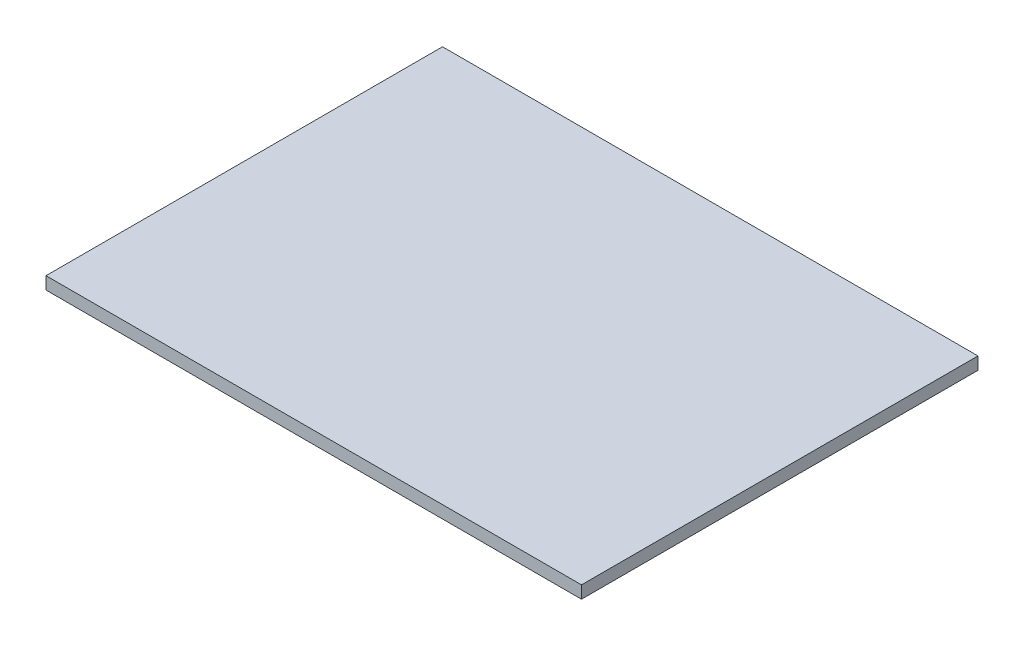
ISO-10303-21;
HEADER;
FILE_DESCRIPTION(('STEP AP214'),'2;1');
FILE_NAME('part.step','',(''),(''),'','','');
FILE_SCHEMA(('AUTOMOTIVE_DESIGN { 1 0 10303 214 1 1 1 1 }'));
ENDSEC;
DATA;
#1=APPLICATION_CONTEXT('core data for automotive mechanical design processes');
#2=APPLICATION_PROTOCOL_DEFINITION('international standard','automotive_design',2000,#1);
#3=PRODUCT_CONTEXT('',#1,'mechanical');
#4=PRODUCT('Part','Part','',(#3));
#5=PRODUCT_RELATED_PRODUCT_CATEGORY('part','',(#4));
#6=PRODUCT_DEFINITION_FORMATION('','',#4);
#7=PRODUCT_DEFINITION_CONTEXT('part definition',#1,'design');
#8=PRODUCT_DEFINITION('design','',#6,#7);
#9=PRODUCT_DEFINITION_SHAPE('','',#8);
#10=(LENGTH_UNIT() NAMED_UNIT(*) SI_UNIT(.MILLI.,.METRE.));
#11=(NAMED_UNIT(*) PLANE_ANGLE_UNIT() SI_UNIT($,.RADIAN.));
#12=(NAMED_UNIT(*) SI_UNIT($,.STERADIAN.) SOLID_ANGLE_UNIT());
#13=UNCERTAINTY_MEASURE_WITH_UNIT(LENGTH_MEASURE(1.E-05),#10,'distance_accuracy_value','');
#14=(GEOMETRIC_REPRESENTATION_CONTEXT(3) GLOBAL_UNCERTAINTY_ASSIGNED_CONTEXT((#13)) GLOBAL_UNIT_ASSIGNED_CONTEXT((#10,
#11,#12)) REPRESENTATION_CONTEXT('',''));
#15=CARTESIAN_POINT('',(0.,0.,0.));
#16=DIRECTION('',(0.,0.,1.));
#17=DIRECTION('',(1.,0.,0.));
#18=AXIS2_PLACEMENT_3D('',#15,#16,#17);
#19=CARTESIAN_POINT('',(-8.12013274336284,2.54,11.6596777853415));
#20=DIRECTION('',(1.,0.,0.));
#21=DIRECTION('',(0.,0.,-1.));
#22=AXIS2_PLACEMENT_3D('',#19,#20,#21);
#23=PLANE('',#22);
#24=DIRECTION('',(0.,0.,1.));
#25=VECTOR('',#24,1.);
#26=CARTESIAN_POINT('',(-8.12013274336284,0.,11.6596777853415));
#27=LINE('',#26,#25);
#28=CARTESIAN_POINT('',(-8.12013274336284,0.,-69.1252325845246));
#29=VERTEX_POINT('',#28);
#30=CARTESIAN_POINT('',(-8.12013274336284,0.,11.6596777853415));
#31=VERTEX_POINT('',#30);
#32=EDGE_CURVE('E98',#29,#31,#27,.T.);
#33=ORIENTED_EDGE('',*,*,#32,.T.);
#34=DIRECTION('',(0.,-1.,0.));
#35=VECTOR('',#34,1.);
#36=CARTESIAN_POINT('',(-8.12013274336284,2.54,11.6596777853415));
#37=LINE('',#36,#35);
#38=CARTESIAN_POINT('',(-8.12013274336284,2.54,11.6596777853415));
#39=VERTEX_POINT('',#38);
#40=EDGE_CURVE('E11',#39,#31,#37,.T.);
#41=ORIENTED_EDGE('',*,*,#40,.F.);
#42=DIRECTION('',(0.,0.,1.));
#43=VECTOR('',#42,1.);
#44=CARTESIAN_POINT('',(-8.12013274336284,2.54,11.6596777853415));
#45=LINE('',#44,#43);
#46=CARTESIAN_POINT('',(-8.12013274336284,2.54,-69.1252325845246));
#47=VERTEX_POINT('',#46);
#48=EDGE_CURVE('E86',#47,#39,#45,.T.);
#49=ORIENTED_EDGE('',*,*,#48,.F.);
#50=DIRECTION('',(0.,-1.,0.));
#51=VECTOR('',#50,1.);
#52=CARTESIAN_POINT('',(-8.12013274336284,2.54,-69.1252325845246));
#53=LINE('',#52,#51);
#54=EDGE_CURVE('E94',#47,#29,#53,.T.);
#55=ORIENTED_EDGE('',*,*,#54,.T.);
#56=EDGE_LOOP('',(#33,#41,#49,#55));
#57=FACE_BOUND('',#56,.T.);
#58=ADVANCED_FACE('F35',(#57),#23,.F.);
#59=CARTESIAN_POINT('',(-8.12013274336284,2.54,11.6596777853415));
#60=DIRECTION('',(0.,0.,-1.));
#61=DIRECTION('',(-1.,0.,0.));
#62=AXIS2_PLACEMENT_3D('',#59,#60,#61);
#63=PLANE('',#62);
#64=DIRECTION('',(1.,0.,0.));
#65=VECTOR('',#64,1.);
#66=CARTESIAN_POINT('',(-8.12013274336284,0.,11.6596777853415));
#67=LINE('',#66,#65);
#68=CARTESIAN_POINT('',(100.981137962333,0.,11.6596777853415));
#69=VERTEX_POINT('',#68);
#70=EDGE_CURVE('E90',#31,#69,#67,.T.);
#71=ORIENTED_EDGE('',*,*,#70,.T.);
#72=DIRECTION('',(0.,-1.,0.));
#73=VECTOR('',#72,1.);
#74=CARTESIAN_POINT('',(100.981137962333,2.54,11.6596777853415));
#75=LINE('',#74,#73);
#76=CARTESIAN_POINT('',(100.981137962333,2.54,11.6596777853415));
#77=VERTEX_POINT('',#76);
#78=EDGE_CURVE('E43',#77,#69,#75,.T.);
#79=ORIENTED_EDGE('',*,*,#78,.F.);
#80=DIRECTION('',(1.,0.,0.));
#81=VECTOR('',#80,1.);
#82=CARTESIAN_POINT('',(-8.12013274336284,2.54,11.6596777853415));
#83=LINE('',#82,#81);
#84=EDGE_CURVE('E81',#39,#77,#83,.T.);
#85=ORIENTED_EDGE('',*,*,#84,.F.);
#86=ORIENTED_EDGE('',*,*,#40,.T.);
#87=EDGE_LOOP('',(#71,#79,#85,#86));
#88=FACE_BOUND('',#87,.T.);
#89=ADVANCED_FACE('F89',(#88),#63,.F.);
#90=CARTESIAN_POINT('',(100.981137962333,2.54,11.6596777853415));
#91=DIRECTION('',(-1.,0.,0.));
#92=DIRECTION('',(0.,0.,1.));
#93=AXIS2_PLACEMENT_3D('',#90,#91,#92);
#94=PLANE('',#93);
#95=DIRECTION('',(0.,0.,-1.));
#96=VECTOR('',#95,1.);
#97=CARTESIAN_POINT('',(100.981137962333,0.,11.6596777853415));
#98=LINE('',#97,#96);
#99=CARTESIAN_POINT('',(100.981137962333,0.,-69.1252325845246));
#100=VERTEX_POINT('',#99);
#101=EDGE_CURVE('E68',#69,#100,#98,.T.);
#102=ORIENTED_EDGE('',*,*,#101,.T.);
#103=DIRECTION('',(0.,-1.,0.));
#104=VECTOR('',#103,1.);
#105=CARTESIAN_POINT('',(100.981137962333,2.54,-69.1252325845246));
#106=LINE('',#105,#104);
#107=CARTESIAN_POINT('',(100.981137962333,2.54,-69.1252325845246));
#108=VERTEX_POINT('',#107);
#109=EDGE_CURVE('E91',#108,#100,#106,.T.);
#110=ORIENTED_EDGE('',*,*,#109,.F.);
#111=DIRECTION('',(0.,0.,-1.));
#112=VECTOR('',#111,1.);
#113=CARTESIAN_POINT('',(100.981137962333,2.54,11.6596777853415));
#114=LINE('',#113,#112);
#115=EDGE_CURVE('E84',#77,#108,#114,.T.);
#116=ORIENTED_EDGE('',*,*,#115,.F.);
#117=ORIENTED_EDGE('',*,*,#78,.T.);
#118=EDGE_LOOP('',(#102,#110,#116,#117));
#119=FACE_BOUND('',#118,.T.);
#120=ADVANCED_FACE('F92',(#119),#94,.F.);
#121=CARTESIAN_POINT('',(-8.12013274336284,2.54,-69.1252325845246));
#122=DIRECTION('',(0.,0.,1.));
#123=DIRECTION('',(1.,0.,0.));
#124=AXIS2_PLACEMENT_3D('',#121,#122,#123);
#125=PLANE('',#124);
#126=DIRECTION('',(-1.,0.,0.));
#127=VECTOR('',#126,1.);
#128=CARTESIAN_POINT('',(-8.12013274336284,0.,-69.1252325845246));
#129=LINE('',#128,#127);
#130=EDGE_CURVE('E74',#100,#29,#129,.T.);
#131=ORIENTED_EDGE('',*,*,#130,.T.);
#132=ORIENTED_EDGE('',*,*,#54,.F.);
#133=DIRECTION('',(-1.,0.,0.));
#134=VECTOR('',#133,1.);
#135=CARTESIAN_POINT('',(-8.12013274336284,2.54,-69.1252325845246));
#136=LINE('',#135,#134);
#137=EDGE_CURVE('E51',#108,#47,#136,.T.);
#138=ORIENTED_EDGE('',*,*,#137,.F.);
#139=ORIENTED_EDGE('',*,*,#109,.T.);
#140=EDGE_LOOP('',(#131,#132,#138,#139));
#141=FACE_BOUND('',#140,.T.);
#142=ADVANCED_FACE('F105',(#141),#125,.F.);
#143=CARTESIAN_POINT('',(0.,2.54,0.));
#144=DIRECTION('',(0.,-1.,0.));
#145=DIRECTION('',(0.,0.,-1.));
#146=AXIS2_PLACEMENT_3D('',#143,#144,#145);
#147=PLANE('',#146);
#148=ORIENTED_EDGE('',*,*,#48,.T.);
#149=ORIENTED_EDGE('',*,*,#84,.T.);
#150=ORIENTED_EDGE('',*,*,#115,.T.);
#151=ORIENTED_EDGE('',*,*,#137,.T.);
#152=EDGE_LOOP('',(#148,#149,#150,#151));
#153=FACE_BOUND('',#152,.T.);
#154=ADVANCED_FACE('F82',(#153),#147,.F.);
#155=CARTESIAN_POINT('',(0.,0.,0.));
#156=DIRECTION('',(0.,-1.,0.));
#157=DIRECTION('',(0.,0.,-1.));
#158=AXIS2_PLACEMENT_3D('',#155,#156,#157);
#159=PLANE('',#158);
#160=ORIENTED_EDGE('',*,*,#32,.F.);
#161=ORIENTED_EDGE('',*,*,#130,.F.);
#162=ORIENTED_EDGE('',*,*,#101,.F.);
#163=ORIENTED_EDGE('',*,*,#70,.F.);
#164=EDGE_LOOP('',(#160,#161,#162,#163));
#165=FACE_BOUND('',#164,.T.);
#166=ADVANCED_FACE('F108',(#165),#159,.T.);
#167=CLOSED_SHELL('',(#58,#89,#120,#142,#154,#166));
#168=MANIFOLD_SOLID_BREP('B2',#167);
#169=ADVANCED_BREP_SHAPE_REPRESENTATION('',(#18,#168),#14);
#170=SHAPE_DEFINITION_REPRESENTATION(#9,#169);
ENDSEC;
END-ISO-10303-21;
